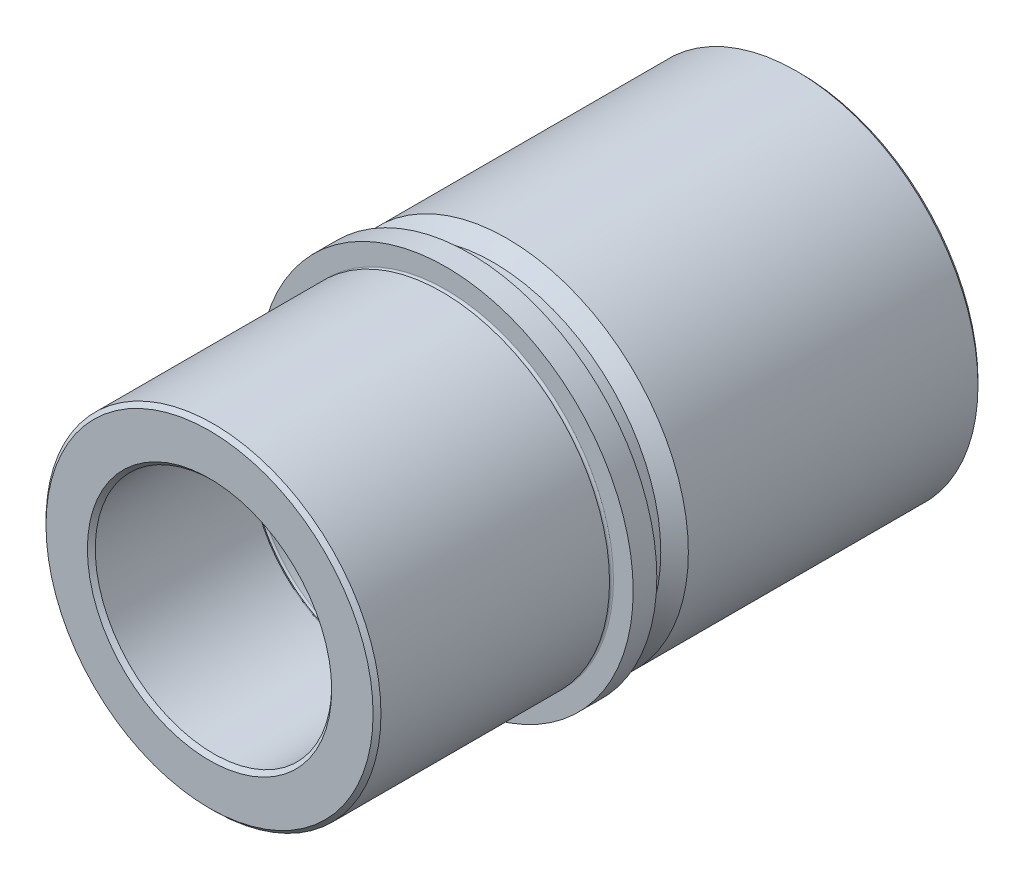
ISO-10303-21;
HEADER;
FILE_DESCRIPTION(('STEP AP214'),'2;1');
FILE_NAME('part.step','',(''),(''),'','','');
FILE_SCHEMA(('AUTOMOTIVE_DESIGN { 1 0 10303 214 1 1 1 1 }'));
ENDSEC;
DATA;
#1=APPLICATION_CONTEXT('core data for automotive mechanical design processes');
#2=APPLICATION_PROTOCOL_DEFINITION('international standard','automotive_design',2000,#1);
#3=PRODUCT_CONTEXT('',#1,'mechanical');
#4=PRODUCT('Part','Part','',(#3));
#5=PRODUCT_RELATED_PRODUCT_CATEGORY('part','',(#4));
#6=PRODUCT_DEFINITION_FORMATION('','',#4);
#7=PRODUCT_DEFINITION_CONTEXT('part definition',#1,'design');
#8=PRODUCT_DEFINITION('design','',#6,#7);
#9=PRODUCT_DEFINITION_SHAPE('','',#8);
#10=(LENGTH_UNIT() NAMED_UNIT(*) SI_UNIT(.MILLI.,.METRE.));
#11=(NAMED_UNIT(*) PLANE_ANGLE_UNIT() SI_UNIT($,.RADIAN.));
#12=(NAMED_UNIT(*) SI_UNIT($,.STERADIAN.) SOLID_ANGLE_UNIT());
#13=UNCERTAINTY_MEASURE_WITH_UNIT(LENGTH_MEASURE(1.E-05),#10,'distance_accuracy_value','');
#14=(GEOMETRIC_REPRESENTATION_CONTEXT(3) GLOBAL_UNCERTAINTY_ASSIGNED_CONTEXT((#13)) GLOBAL_UNIT_ASSIGNED_CONTEXT((#10,
#11,#12)) REPRESENTATION_CONTEXT('',''));
#15=CARTESIAN_POINT('',(0.,0.,0.));
#16=DIRECTION('',(0.,0.,1.));
#17=DIRECTION('',(1.,0.,0.));
#18=AXIS2_PLACEMENT_3D('',#15,#16,#17);
#19=CARTESIAN_POINT('',(0.,0.,-97.5));
#20=DIRECTION('',(0.,0.,1.));
#21=DIRECTION('',(1.,0.,0.));
#22=AXIS2_PLACEMENT_3D('',#19,#20,#21);
#23=TOROIDAL_SURFACE('',#22,30.5,0.5);
#24=CARTESIAN_POINT('',(0.,0.,-97.5));
#25=DIRECTION('',(0.,0.,1.));
#26=DIRECTION('',(1.,0.,0.));
#27=AXIS2_PLACEMENT_3D('',#24,#25,#26);
#28=CIRCLE('',#27,30.);
#29=CARTESIAN_POINT('',(30.,0.,-97.5));
#30=VERTEX_POINT('',#29);
#31=EDGE_CURVE('E81',#30,#30,#28,.T.);
#32=ORIENTED_EDGE('',*,*,#31,.T.);
#33=EDGE_LOOP('',(#32));
#34=FACE_BOUND('',#33,.T.);
#35=CARTESIAN_POINT('',(0.,0.,-98.));
#36=DIRECTION('',(0.,0.,1.));
#37=DIRECTION('',(1.,0.,0.));
#38=AXIS2_PLACEMENT_3D('',#35,#36,#37);
#39=CIRCLE('',#38,30.5);
#40=CARTESIAN_POINT('',(30.5,0.,-98.));
#41=VERTEX_POINT('',#40);
#42=EDGE_CURVE('E45',#41,#41,#39,.T.);
#43=ORIENTED_EDGE('',*,*,#42,.F.);
#44=EDGE_LOOP('',(#43));
#45=FACE_BOUND('',#44,.T.);
#46=ADVANCED_FACE('F13',(#34,#45),#23,.T.);
#47=CARTESIAN_POINT('',(0.,0.,-98.5));
#48=DIRECTION('',(0.,0.,1.));
#49=DIRECTION('',(1.,0.,0.));
#50=AXIS2_PLACEMENT_3D('',#47,#48,#49);
#51=TOROIDAL_SURFACE('',#50,30.5,0.5);
#52=CARTESIAN_POINT('',(0.,0.,-98.5));
#53=DIRECTION('',(0.,0.,1.));
#54=DIRECTION('',(1.,0.,0.));
#55=AXIS2_PLACEMENT_3D('',#52,#53,#54);
#56=CIRCLE('',#55,30.);
#57=CARTESIAN_POINT('',(30.,0.,-98.5));
#58=VERTEX_POINT('',#57);
#59=EDGE_CURVE('E48',#58,#58,#56,.T.);
#60=ORIENTED_EDGE('',*,*,#59,.F.);
#61=EDGE_LOOP('',(#60));
#62=FACE_BOUND('',#61,.T.);
#63=ORIENTED_EDGE('',*,*,#42,.T.);
#64=EDGE_LOOP('',(#63));
#65=FACE_BOUND('',#64,.T.);
#66=ADVANCED_FACE('F113',(#62,#65),#51,.T.);
#67=CARTESIAN_POINT('',(0.,0.,0.));
#68=DIRECTION('',(0.,0.,1.));
#69=DIRECTION('',(1.,0.,0.));
#70=AXIS2_PLACEMENT_3D('',#67,#68,#69);
#71=CYLINDRICAL_SURFACE('',#70,30.);
#72=CARTESIAN_POINT('',(0.,0.,-149.));
#73=DIRECTION('',(0.,0.,1.));
#74=DIRECTION('',(1.,0.,0.));
#75=AXIS2_PLACEMENT_3D('',#72,#73,#74);
#76=CIRCLE('',#75,30.);
#77=CARTESIAN_POINT('',(30.,0.,-149.));
#78=VERTEX_POINT('',#77);
#79=EDGE_CURVE('E36',#78,#78,#76,.F.);
#80=ORIENTED_EDGE('',*,*,#79,.T.);
#81=EDGE_LOOP('',(#80));
#82=FACE_BOUND('',#81,.T.);
#83=ORIENTED_EDGE('',*,*,#59,.T.);
#84=EDGE_LOOP('',(#83));
#85=FACE_BOUND('',#84,.T.);
#86=ADVANCED_FACE('F118',(#82,#85),#71,.F.);
#87=CARTESIAN_POINT('',(0.,0.,-150.));
#88=DIRECTION('',(0.,0.,1.));
#89=DIRECTION('',(1.,0.,0.));
#90=AXIS2_PLACEMENT_3D('',#87,#88,#89);
#91=PLANE('',#90);
#92=CARTESIAN_POINT('',(0.,0.,-150.));
#93=DIRECTION('',(0.,0.,1.));
#94=DIRECTION('',(1.,0.,0.));
#95=AXIS2_PLACEMENT_3D('',#92,#93,#94);
#96=CIRCLE('',#95,31.);
#97=CARTESIAN_POINT('',(31.,0.,-150.));
#98=VERTEX_POINT('',#97);
#99=EDGE_CURVE('E39',#98,#98,#96,.T.);
#100=ORIENTED_EDGE('',*,*,#99,.T.);
#101=EDGE_LOOP('',(#100));
#102=FACE_BOUND('',#101,.T.);
#103=CARTESIAN_POINT('',(0.,0.,-150.));
#104=DIRECTION('',(0.,0.,1.));
#105=DIRECTION('',(1.,0.,0.));
#106=AXIS2_PLACEMENT_3D('',#103,#104,#105);
#107=CIRCLE('',#106,45.);
#108=CARTESIAN_POINT('',(45.,0.,-150.));
#109=VERTEX_POINT('',#108);
#110=EDGE_CURVE('E42',#109,#109,#107,.F.);
#111=ORIENTED_EDGE('',*,*,#110,.T.);
#112=EDGE_LOOP('',(#111));
#113=FACE_BOUND('',#112,.T.);
#114=ADVANCED_FACE('F185',(#102,#113),#91,.F.);
#115=CARTESIAN_POINT('',(0.,0.,0.));
#116=DIRECTION('',(0.,0.,1.));
#117=DIRECTION('',(1.,0.,0.));
#118=AXIS2_PLACEMENT_3D('',#115,#116,#117);
#119=CYLINDRICAL_SURFACE('',#118,46.);
#120=CARTESIAN_POINT('',(0.,0.,-149.));
#121=DIRECTION('',(0.,0.,1.));
#122=DIRECTION('',(1.,0.,0.));
#123=AXIS2_PLACEMENT_3D('',#120,#121,#122);
#124=CIRCLE('',#123,46.);
#125=CARTESIAN_POINT('',(46.,0.,-149.));
#126=VERTEX_POINT('',#125);
#127=EDGE_CURVE('E33',#126,#126,#124,.T.);
#128=ORIENTED_EDGE('',*,*,#127,.T.);
#129=EDGE_LOOP('',(#128));
#130=FACE_BOUND('',#129,.T.);
#131=CARTESIAN_POINT('',(0.,0.,-75.5));
#132=DIRECTION('',(0.,0.,1.));
#133=DIRECTION('',(1.,0.,0.));
#134=AXIS2_PLACEMENT_3D('',#131,#132,#133);
#135=CIRCLE('',#134,46.);
#136=CARTESIAN_POINT('',(46.,0.,-75.5));
#137=VERTEX_POINT('',#136);
#138=EDGE_CURVE('E51',#137,#137,#135,.T.);
#139=ORIENTED_EDGE('',*,*,#138,.F.);
#140=EDGE_LOOP('',(#139));
#141=FACE_BOUND('',#140,.T.);
#142=ADVANCED_FACE('F181',(#130,#141),#119,.T.);
#143=CARTESIAN_POINT('',(0.,0.,-72.));
#144=DIRECTION('',(0.,0.,-1.));
#145=DIRECTION('',(-1.,0.,0.));
#146=AXIS2_PLACEMENT_3D('',#143,#144,#145);
#147=CONICAL_SURFACE('',#146,42.5,0.78539816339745);
#148=ORIENTED_EDGE('',*,*,#138,.T.);
#149=EDGE_LOOP('',(#148));
#150=FACE_BOUND('',#149,.T.);
#151=CARTESIAN_POINT('',(0.,0.,-72.));
#152=DIRECTION('',(0.,0.,1.));
#153=DIRECTION('',(1.,0.,0.));
#154=AXIS2_PLACEMENT_3D('',#151,#152,#153);
#155=CIRCLE('',#154,42.5);
#156=CARTESIAN_POINT('',(42.5,0.,-72.));
#157=VERTEX_POINT('',#156);
#158=EDGE_CURVE('E54',#157,#157,#155,.T.);
#159=ORIENTED_EDGE('',*,*,#158,.F.);
#160=EDGE_LOOP('',(#159));
#161=FACE_BOUND('',#160,.T.);
#162=ADVANCED_FACE('F177',(#150,#161),#147,.T.);
#163=CARTESIAN_POINT('',(0.,0.,0.));
#164=DIRECTION('',(0.,0.,1.));
#165=DIRECTION('',(1.,0.,0.));
#166=AXIS2_PLACEMENT_3D('',#163,#164,#165);
#167=CYLINDRICAL_SURFACE('',#166,42.5);
#168=ORIENTED_EDGE('',*,*,#158,.T.);
#169=EDGE_LOOP('',(#168));
#170=FACE_BOUND('',#169,.T.);
#171=CARTESIAN_POINT('',(0.,0.,-66.));
#172=DIRECTION('',(0.,0.,1.));
#173=DIRECTION('',(1.,0.,0.));
#174=AXIS2_PLACEMENT_3D('',#171,#172,#173);
#175=CIRCLE('',#174,42.5);
#176=CARTESIAN_POINT('',(42.5,0.,-66.));
#177=VERTEX_POINT('',#176);
#178=EDGE_CURVE('E57',#177,#177,#175,.T.);
#179=ORIENTED_EDGE('',*,*,#178,.F.);
#180=EDGE_LOOP('',(#179));
#181=FACE_BOUND('',#180,.T.);
#182=ADVANCED_FACE('F173',(#170,#181),#167,.T.);
#183=CARTESIAN_POINT('',(0.,0.,-66.));
#184=DIRECTION('',(0.,0.,-1.));
#185=DIRECTION('',(-1.,0.,0.));
#186=AXIS2_PLACEMENT_3D('',#183,#184,#185);
#187=PLANE('',#186);
#188=ORIENTED_EDGE('',*,*,#178,.T.);
#189=EDGE_LOOP('',(#188));
#190=FACE_BOUND('',#189,.T.);
#191=CARTESIAN_POINT('',(0.,0.,-66.));
#192=DIRECTION('',(0.,0.,1.));
#193=DIRECTION('',(1.,0.,0.));
#194=AXIS2_PLACEMENT_3D('',#191,#192,#193);
#195=CIRCLE('',#194,47.5);
#196=CARTESIAN_POINT('',(47.5,0.,-66.));
#197=VERTEX_POINT('',#196);
#198=EDGE_CURVE('E60',#197,#197,#195,.T.);
#199=ORIENTED_EDGE('',*,*,#198,.F.);
#200=EDGE_LOOP('',(#199));
#201=FACE_BOUND('',#200,.T.);
#202=ADVANCED_FACE('F169',(#190,#201),#187,.T.);
#203=CARTESIAN_POINT('',(0.,0.,0.));
#204=DIRECTION('',(0.,0.,1.));
#205=DIRECTION('',(1.,0.,0.));
#206=AXIS2_PLACEMENT_3D('',#203,#204,#205);
#207=CYLINDRICAL_SURFACE('',#206,47.5);
#208=ORIENTED_EDGE('',*,*,#198,.T.);
#209=EDGE_LOOP('',(#208));
#210=FACE_BOUND('',#209,.T.);
#211=CARTESIAN_POINT('',(0.,0.,-60.));
#212=DIRECTION('',(0.,0.,1.));
#213=DIRECTION('',(1.,0.,0.));
#214=AXIS2_PLACEMENT_3D('',#211,#212,#213);
#215=CIRCLE('',#214,47.5);
#216=CARTESIAN_POINT('',(47.5,0.,-60.));
#217=VERTEX_POINT('',#216);
#218=EDGE_CURVE('E63',#217,#217,#215,.T.);
#219=ORIENTED_EDGE('',*,*,#218,.F.);
#220=EDGE_LOOP('',(#219));
#221=FACE_BOUND('',#220,.T.);
#222=ADVANCED_FACE('F165',(#210,#221),#207,.T.);
#223=CARTESIAN_POINT('',(0.,0.,-60.));
#224=DIRECTION('',(0.,0.,1.));
#225=DIRECTION('',(1.,0.,0.));
#226=AXIS2_PLACEMENT_3D('',#223,#224,#225);
#227=PLANE('',#226);
#228=ORIENTED_EDGE('',*,*,#218,.T.);
#229=EDGE_LOOP('',(#228));
#230=FACE_BOUND('',#229,.T.);
#231=CARTESIAN_POINT('',(0.,0.,-60.));
#232=DIRECTION('',(0.,0.,1.));
#233=DIRECTION('',(1.,0.,0.));
#234=AXIS2_PLACEMENT_3D('',#231,#232,#233);
#235=CIRCLE('',#234,42.5);
#236=CARTESIAN_POINT('',(42.5,0.,-60.));
#237=VERTEX_POINT('',#236);
#238=EDGE_CURVE('E66',#237,#237,#235,.T.);
#239=ORIENTED_EDGE('',*,*,#238,.F.);
#240=EDGE_LOOP('',(#239));
#241=FACE_BOUND('',#240,.T.);
#242=ADVANCED_FACE('F161',(#230,#241),#227,.T.);
#243=CARTESIAN_POINT('',(0.,0.,-59.5));
#244=DIRECTION('',(0.,0.,1.));
#245=DIRECTION('',(1.,0.,0.));
#246=AXIS2_PLACEMENT_3D('',#243,#244,#245);
#247=TOROIDAL_SURFACE('',#246,42.5,0.5);
#248=ORIENTED_EDGE('',*,*,#238,.T.);
#249=EDGE_LOOP('',(#248));
#250=FACE_BOUND('',#249,.T.);
#251=CARTESIAN_POINT('',(0.,0.,-59.));
#252=DIRECTION('',(0.,0.,1.));
#253=DIRECTION('',(1.,0.,0.));
#254=AXIS2_PLACEMENT_3D('',#251,#252,#253);
#255=CIRCLE('',#254,42.5);
#256=CARTESIAN_POINT('',(42.5,0.,-59.));
#257=VERTEX_POINT('',#256);
#258=EDGE_CURVE('E69',#257,#257,#255,.T.);
#259=ORIENTED_EDGE('',*,*,#258,.F.);
#260=EDGE_LOOP('',(#259));
#261=FACE_BOUND('',#260,.T.);
#262=ADVANCED_FACE('F156',(#250,#261),#247,.F.);
#263=CARTESIAN_POINT('',(0.,0.,0.));
#264=DIRECTION('',(0.,0.,1.));
#265=DIRECTION('',(1.,0.,0.));
#266=AXIS2_PLACEMENT_3D('',#263,#264,#265);
#267=CYLINDRICAL_SURFACE('',#266,42.5);
#268=CARTESIAN_POINT('',(0.,0.,-1.));
#269=DIRECTION('',(0.,0.,1.));
#270=DIRECTION('',(1.,0.,0.));
#271=AXIS2_PLACEMENT_3D('',#268,#269,#270);
#272=CIRCLE('',#271,42.5);
#273=CARTESIAN_POINT('',(42.5,0.,-1.));
#274=VERTEX_POINT('',#273);
#275=EDGE_CURVE('E8',#274,#274,#272,.F.);
#276=ORIENTED_EDGE('',*,*,#275,.T.);
#277=EDGE_LOOP('',(#276));
#278=FACE_BOUND('',#277,.T.);
#279=ORIENTED_EDGE('',*,*,#258,.T.);
#280=EDGE_LOOP('',(#279));
#281=FACE_BOUND('',#280,.T.);
#282=ADVANCED_FACE('F149',(#278,#281),#267,.T.);
#283=CARTESIAN_POINT('',(0.,0.,0.));
#284=DIRECTION('',(0.,0.,1.));
#285=DIRECTION('',(1.,0.,0.));
#286=AXIS2_PLACEMENT_3D('',#283,#284,#285);
#287=PLANE('',#286);
#288=CARTESIAN_POINT('',(0.,0.,0.));
#289=DIRECTION('',(0.,0.,1.));
#290=DIRECTION('',(1.,0.,0.));
#291=AXIS2_PLACEMENT_3D('',#288,#289,#290);
#292=CIRCLE('',#291,31.);
#293=CARTESIAN_POINT('',(31.,0.,0.));
#294=VERTEX_POINT('',#293);
#295=EDGE_CURVE('E20',#294,#294,#292,.F.);
#296=ORIENTED_EDGE('',*,*,#295,.T.);
#297=EDGE_LOOP('',(#296));
#298=FACE_BOUND('',#297,.T.);
#299=CARTESIAN_POINT('',(0.,0.,0.));
#300=DIRECTION('',(0.,0.,1.));
#301=DIRECTION('',(1.,0.,0.));
#302=AXIS2_PLACEMENT_3D('',#299,#300,#301);
#303=CIRCLE('',#302,41.5);
#304=CARTESIAN_POINT('',(41.5,0.,0.));
#305=VERTEX_POINT('',#304);
#306=EDGE_CURVE('E24',#305,#305,#303,.T.);
#307=ORIENTED_EDGE('',*,*,#306,.T.);
#308=EDGE_LOOP('',(#307));
#309=FACE_BOUND('',#308,.T.);
#310=ADVANCED_FACE('F109',(#298,#309),#287,.T.);
#311=CARTESIAN_POINT('',(0.,0.,0.));
#312=DIRECTION('',(0.,0.,1.));
#313=DIRECTION('',(1.,0.,0.));
#314=AXIS2_PLACEMENT_3D('',#311,#312,#313);
#315=CYLINDRICAL_SURFACE('',#314,30.);
#316=CARTESIAN_POINT('',(0.,0.,-1.));
#317=DIRECTION('',(0.,0.,1.));
#318=DIRECTION('',(1.,0.,0.));
#319=AXIS2_PLACEMENT_3D('',#316,#317,#318);
#320=CIRCLE('',#319,30.);
#321=CARTESIAN_POINT('',(30.,0.,-1.));
#322=VERTEX_POINT('',#321);
#323=EDGE_CURVE('E28',#322,#322,#320,.T.);
#324=ORIENTED_EDGE('',*,*,#323,.T.);
#325=EDGE_LOOP('',(#324));
#326=FACE_BOUND('',#325,.T.);
#327=CARTESIAN_POINT('',(0.,0.,-40.5));
#328=DIRECTION('',(0.,0.,1.));
#329=DIRECTION('',(1.,0.,0.));
#330=AXIS2_PLACEMENT_3D('',#327,#328,#329);
#331=CIRCLE('',#330,30.);
#332=CARTESIAN_POINT('',(30.,0.,-40.5));
#333=VERTEX_POINT('',#332);
#334=EDGE_CURVE('E72',#333,#333,#331,.T.);
#335=ORIENTED_EDGE('',*,*,#334,.F.);
#336=EDGE_LOOP('',(#335));
#337=FACE_BOUND('',#336,.T.);
#338=ADVANCED_FACE('F102',(#326,#337),#315,.F.);
#339=CARTESIAN_POINT('',(0.,0.,-40.5));
#340=DIRECTION('',(0.,0.,1.));
#341=DIRECTION('',(1.,0.,0.));
#342=AXIS2_PLACEMENT_3D('',#339,#340,#341);
#343=TOROIDAL_SURFACE('',#342,30.5,0.5);
#344=ORIENTED_EDGE('',*,*,#334,.T.);
#345=EDGE_LOOP('',(#344));
#346=FACE_BOUND('',#345,.T.);
#347=CARTESIAN_POINT('',(0.,0.,-41.));
#348=DIRECTION('',(0.,0.,1.));
#349=DIRECTION('',(1.,0.,0.));
#350=AXIS2_PLACEMENT_3D('',#347,#348,#349);
#351=CIRCLE('',#350,30.5);
#352=CARTESIAN_POINT('',(30.5,0.,-41.));
#353=VERTEX_POINT('',#352);
#354=EDGE_CURVE('E75',#353,#353,#351,.T.);
#355=ORIENTED_EDGE('',*,*,#354,.F.);
#356=EDGE_LOOP('',(#355));
#357=FACE_BOUND('',#356,.T.);
#358=ADVANCED_FACE('F97',(#346,#357),#343,.T.);
#359=CARTESIAN_POINT('',(0.,0.,-41.5));
#360=DIRECTION('',(0.,0.,1.));
#361=DIRECTION('',(1.,0.,0.));
#362=AXIS2_PLACEMENT_3D('',#359,#360,#361);
#363=TOROIDAL_SURFACE('',#362,30.5,0.5);
#364=CARTESIAN_POINT('',(0.,0.,-41.5));
#365=DIRECTION('',(0.,0.,1.));
#366=DIRECTION('',(1.,0.,0.));
#367=AXIS2_PLACEMENT_3D('',#364,#365,#366);
#368=CIRCLE('',#367,30.);
#369=CARTESIAN_POINT('',(30.,0.,-41.5));
#370=VERTEX_POINT('',#369);
#371=EDGE_CURVE('E78',#370,#370,#368,.T.);
#372=ORIENTED_EDGE('',*,*,#371,.F.);
#373=EDGE_LOOP('',(#372));
#374=FACE_BOUND('',#373,.T.);
#375=ORIENTED_EDGE('',*,*,#354,.T.);
#376=EDGE_LOOP('',(#375));
#377=FACE_BOUND('',#376,.T.);
#378=ADVANCED_FACE('F91',(#374,#377),#363,.T.);
#379=CARTESIAN_POINT('',(0.,0.,0.));
#380=DIRECTION('',(0.,0.,1.));
#381=DIRECTION('',(1.,0.,0.));
#382=AXIS2_PLACEMENT_3D('',#379,#380,#381);
#383=CYLINDRICAL_SURFACE('',#382,30.);
#384=ORIENTED_EDGE('',*,*,#31,.F.);
#385=EDGE_LOOP('',(#384));
#386=FACE_BOUND('',#385,.T.);
#387=ORIENTED_EDGE('',*,*,#371,.T.);
#388=EDGE_LOOP('',(#387));
#389=FACE_BOUND('',#388,.T.);
#390=ADVANCED_FACE('F87',(#386,#389),#383,.F.);
#391=CARTESIAN_POINT('',(0.,0.,-150.));
#392=DIRECTION('',(0.,0.,-1.));
#393=DIRECTION('',(-1.,0.,0.));
#394=AXIS2_PLACEMENT_3D('',#391,#392,#393);
#395=CONICAL_SURFACE('',#394,31.,0.785398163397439);
#396=ORIENTED_EDGE('',*,*,#79,.F.);
#397=EDGE_LOOP('',(#396));
#398=FACE_BOUND('',#397,.T.);
#399=ORIENTED_EDGE('',*,*,#99,.F.);
#400=EDGE_LOOP('',(#399));
#401=FACE_BOUND('',#400,.T.);
#402=ADVANCED_FACE('F90',(#398,#401),#395,.F.);
#403=CARTESIAN_POINT('',(0.,0.,-149.));
#404=DIRECTION('',(0.,0.,1.));
#405=DIRECTION('',(1.,0.,0.));
#406=AXIS2_PLACEMENT_3D('',#403,#404,#405);
#407=CONICAL_SURFACE('',#406,46.,0.785398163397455);
#408=ORIENTED_EDGE('',*,*,#110,.F.);
#409=EDGE_LOOP('',(#408));
#410=FACE_BOUND('',#409,.T.);
#411=ORIENTED_EDGE('',*,*,#127,.F.);
#412=EDGE_LOOP('',(#411));
#413=FACE_BOUND('',#412,.T.);
#414=ADVANCED_FACE('F125',(#410,#413),#407,.T.);
#415=CARTESIAN_POINT('',(0.,0.,-1.));
#416=DIRECTION('',(0.,0.,1.));
#417=DIRECTION('',(1.,0.,0.));
#418=AXIS2_PLACEMENT_3D('',#415,#416,#417);
#419=CONICAL_SURFACE('',#418,30.,0.785398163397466);
#420=ORIENTED_EDGE('',*,*,#295,.F.);
#421=EDGE_LOOP('',(#420));
#422=FACE_BOUND('',#421,.T.);
#423=ORIENTED_EDGE('',*,*,#323,.F.);
#424=EDGE_LOOP('',(#423));
#425=FACE_BOUND('',#424,.T.);
#426=ADVANCED_FACE('F128',(#422,#425),#419,.F.);
#427=CARTESIAN_POINT('',(0.,0.,0.));
#428=DIRECTION('',(0.,0.,-1.));
#429=DIRECTION('',(-1.,0.,0.));
#430=AXIS2_PLACEMENT_3D('',#427,#428,#429);
#431=CONICAL_SURFACE('',#430,41.5,0.785398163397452);
#432=ORIENTED_EDGE('',*,*,#275,.F.);
#433=EDGE_LOOP('',(#432));
#434=FACE_BOUND('',#433,.T.);
#435=ORIENTED_EDGE('',*,*,#306,.F.);
#436=EDGE_LOOP('',(#435));
#437=FACE_BOUND('',#436,.T.);
#438=ADVANCED_FACE('F15',(#434,#437),#431,.T.);
#439=CLOSED_SHELL('',(#46,#66,#86,#114,#142,#162,#182,#202,#222,#242,#262,#282,#310,#338,#358,
#378,#390,#402,#414,#426,#438));
#440=MANIFOLD_SOLID_BREP('B1',#439);
#441=ADVANCED_BREP_SHAPE_REPRESENTATION('',(#18,#440),#14);
#442=SHAPE_DEFINITION_REPRESENTATION(#9,#441);
ENDSEC;
END-ISO-10303-21;
